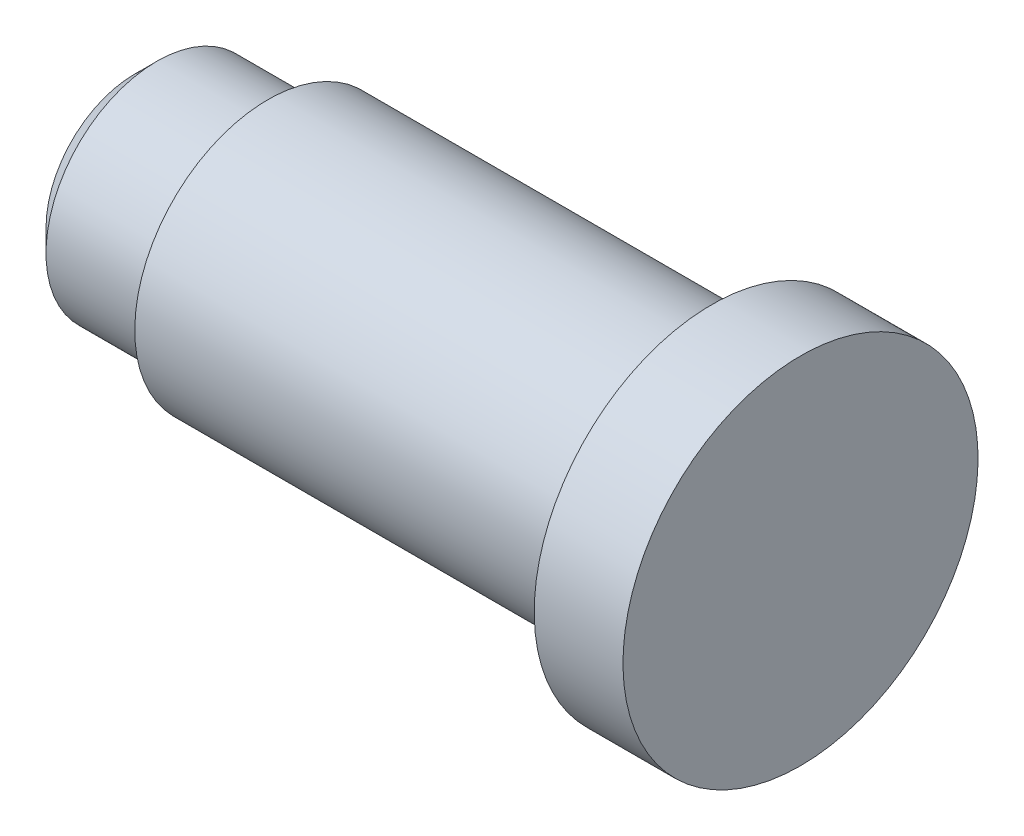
ISO-10303-21;
HEADER;
FILE_DESCRIPTION(('STEP AP214'),'2;1');
FILE_NAME('part.step','',(''),(''),'','','');
FILE_SCHEMA(('AUTOMOTIVE_DESIGN { 1 0 10303 214 1 1 1 1 }'));
ENDSEC;
DATA;
#1=APPLICATION_CONTEXT('core data for automotive mechanical design processes');
#2=APPLICATION_PROTOCOL_DEFINITION('international standard','automotive_design',2000,#1);
#3=PRODUCT_CONTEXT('',#1,'mechanical');
#4=PRODUCT('Part','Part','',(#3));
#5=PRODUCT_RELATED_PRODUCT_CATEGORY('part','',(#4));
#6=PRODUCT_DEFINITION_FORMATION('','',#4);
#7=PRODUCT_DEFINITION_CONTEXT('part definition',#1,'design');
#8=PRODUCT_DEFINITION('design','',#6,#7);
#9=PRODUCT_DEFINITION_SHAPE('','',#8);
#10=(LENGTH_UNIT() NAMED_UNIT(*) SI_UNIT(.MILLI.,.METRE.));
#11=(NAMED_UNIT(*) PLANE_ANGLE_UNIT() SI_UNIT($,.RADIAN.));
#12=(NAMED_UNIT(*) SI_UNIT($,.STERADIAN.) SOLID_ANGLE_UNIT());
#13=UNCERTAINTY_MEASURE_WITH_UNIT(LENGTH_MEASURE(1.E-05),#10,'distance_accuracy_value','');
#14=(GEOMETRIC_REPRESENTATION_CONTEXT(3) GLOBAL_UNCERTAINTY_ASSIGNED_CONTEXT((#13)) GLOBAL_UNIT_ASSIGNED_CONTEXT((#10,
#11,#12)) REPRESENTATION_CONTEXT('',''));
#15=CARTESIAN_POINT('',(0.,0.,0.));
#16=DIRECTION('',(0.,0.,1.));
#17=DIRECTION('',(1.,0.,0.));
#18=AXIS2_PLACEMENT_3D('',#15,#16,#17);
#19=CARTESIAN_POINT('',(-21.7406772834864,1.99999999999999,0.));
#20=DIRECTION('',(1.,0.,0.));
#21=DIRECTION('',(0.,1.,0.));
#22=AXIS2_PLACEMENT_3D('',#19,#20,#21);
#23=PLANE('',#22);
#24=CARTESIAN_POINT('',(-21.7406772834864,0.,0.));
#25=DIRECTION('',(-1.,0.,0.));
#26=DIRECTION('',(0.,-1.,0.));
#27=AXIS2_PLACEMENT_3D('',#24,#25,#26);
#28=CIRCLE('',#27,1.99999999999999);
#29=CARTESIAN_POINT('',(-21.7406772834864,-1.99999999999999,0.));
#30=VERTEX_POINT('',#29);
#31=EDGE_CURVE('E55',#30,#30,#28,.T.);
#32=ORIENTED_EDGE('',*,*,#31,.T.);
#33=EDGE_LOOP('',(#32));
#34=FACE_BOUND('',#33,.T.);
#35=ADVANCED_FACE('F30',(#34),#23,.F.);
#36=CARTESIAN_POINT('',(-6.74067728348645,4.,0.));
#37=DIRECTION('',(-1.,0.,0.));
#38=DIRECTION('',(0.,-1.,0.));
#39=AXIS2_PLACEMENT_3D('',#36,#37,#38);
#40=PLANE('',#39);
#41=CARTESIAN_POINT('',(-6.74067728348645,0.,0.));
#42=DIRECTION('',(-1.,0.,0.));
#43=DIRECTION('',(0.,-1.,0.));
#44=AXIS2_PLACEMENT_3D('',#41,#42,#43);
#45=CIRCLE('',#44,4.);
#46=CARTESIAN_POINT('',(-6.74067728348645,-4.,0.));
#47=VERTEX_POINT('',#46);
#48=EDGE_CURVE('E10',#47,#47,#45,.T.);
#49=ORIENTED_EDGE('',*,*,#48,.F.);
#50=EDGE_LOOP('',(#49));
#51=FACE_BOUND('',#50,.T.);
#52=ADVANCED_FACE('F91',(#51),#40,.F.);
#53=CARTESIAN_POINT('',(-21.7406772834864,0.,0.));
#54=DIRECTION('',(-1.,0.,0.));
#55=DIRECTION('',(0.,-1.,0.));
#56=AXIS2_PLACEMENT_3D('',#53,#54,#55);
#57=CYLINDRICAL_SURFACE('',#56,4.);
#58=CARTESIAN_POINT('',(-8.74067728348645,0.,0.));
#59=DIRECTION('',(-1.,0.,0.));
#60=DIRECTION('',(0.,-1.,0.));
#61=AXIS2_PLACEMENT_3D('',#58,#59,#60);
#62=CIRCLE('',#61,4.);
#63=CARTESIAN_POINT('',(-8.74067728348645,-4.,0.));
#64=VERTEX_POINT('',#63);
#65=EDGE_CURVE('E36',#64,#64,#62,.T.);
#66=ORIENTED_EDGE('',*,*,#65,.F.);
#67=EDGE_LOOP('',(#66));
#68=FACE_BOUND('',#67,.T.);
#69=ORIENTED_EDGE('',*,*,#48,.T.);
#70=EDGE_LOOP('',(#69));
#71=FACE_BOUND('',#70,.T.);
#72=ADVANCED_FACE('F86',(#68,#71),#57,.T.);
#73=CARTESIAN_POINT('',(-8.74067728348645,3.,0.));
#74=DIRECTION('',(1.,0.,0.));
#75=DIRECTION('',(0.,1.,0.));
#76=AXIS2_PLACEMENT_3D('',#73,#74,#75);
#77=PLANE('',#76);
#78=CARTESIAN_POINT('',(-8.74067728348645,0.,0.));
#79=DIRECTION('',(-1.,0.,0.));
#80=DIRECTION('',(0.,-1.,0.));
#81=AXIS2_PLACEMENT_3D('',#78,#79,#80);
#82=CIRCLE('',#81,3.);
#83=CARTESIAN_POINT('',(-8.74067728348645,-3.,0.));
#84=VERTEX_POINT('',#83);
#85=EDGE_CURVE('E40',#84,#84,#82,.T.);
#86=ORIENTED_EDGE('',*,*,#85,.F.);
#87=EDGE_LOOP('',(#86));
#88=FACE_BOUND('',#87,.T.);
#89=ORIENTED_EDGE('',*,*,#65,.T.);
#90=EDGE_LOOP('',(#89));
#91=FACE_BOUND('',#90,.T.);
#92=ADVANCED_FACE('F81',(#88,#91),#77,.F.);
#93=CARTESIAN_POINT('',(-21.7406772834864,0.,0.));
#94=DIRECTION('',(-1.,0.,0.));
#95=DIRECTION('',(0.,-1.,0.));
#96=AXIS2_PLACEMENT_3D('',#93,#94,#95);
#97=CYLINDRICAL_SURFACE('',#96,3.);
#98=CARTESIAN_POINT('',(-18.7406772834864,0.,0.));
#99=DIRECTION('',(-1.,0.,0.));
#100=DIRECTION('',(0.,-1.,0.));
#101=AXIS2_PLACEMENT_3D('',#98,#99,#100);
#102=CIRCLE('',#101,3.);
#103=CARTESIAN_POINT('',(-18.7406772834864,-3.,0.));
#104=VERTEX_POINT('',#103);
#105=EDGE_CURVE('E44',#104,#104,#102,.T.);
#106=ORIENTED_EDGE('',*,*,#105,.F.);
#107=EDGE_LOOP('',(#106));
#108=FACE_BOUND('',#107,.T.);
#109=ORIENTED_EDGE('',*,*,#85,.T.);
#110=EDGE_LOOP('',(#109));
#111=FACE_BOUND('',#110,.T.);
#112=ADVANCED_FACE('F75',(#108,#111),#97,.T.);
#113=CARTESIAN_POINT('',(-18.7406772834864,3.,0.));
#114=DIRECTION('',(1.,0.,0.));
#115=DIRECTION('',(0.,1.,0.));
#116=AXIS2_PLACEMENT_3D('',#113,#114,#115);
#117=PLANE('',#116);
#118=CARTESIAN_POINT('',(-18.7406772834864,0.,0.));
#119=DIRECTION('',(-1.,0.,0.));
#120=DIRECTION('',(0.,-1.,0.));
#121=AXIS2_PLACEMENT_3D('',#118,#119,#120);
#122=CIRCLE('',#121,2.5);
#123=CARTESIAN_POINT('',(-18.7406772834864,-2.5,0.));
#124=VERTEX_POINT('',#123);
#125=EDGE_CURVE('E49',#124,#124,#122,.T.);
#126=ORIENTED_EDGE('',*,*,#125,.F.);
#127=EDGE_LOOP('',(#126));
#128=FACE_BOUND('',#127,.T.);
#129=ORIENTED_EDGE('',*,*,#105,.T.);
#130=EDGE_LOOP('',(#129));
#131=FACE_BOUND('',#130,.T.);
#132=ADVANCED_FACE('F69',(#128,#131),#117,.F.);
#133=CARTESIAN_POINT('',(-21.7406772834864,0.,0.));
#134=DIRECTION('',(-1.,0.,0.));
#135=DIRECTION('',(0.,-1.,0.));
#136=AXIS2_PLACEMENT_3D('',#133,#134,#135);
#137=CYLINDRICAL_SURFACE('',#136,2.5);
#138=CARTESIAN_POINT('',(-21.2406772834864,0.,0.));
#139=DIRECTION('',(-1.,0.,0.));
#140=DIRECTION('',(0.,-1.,0.));
#141=AXIS2_PLACEMENT_3D('',#138,#139,#140);
#142=CIRCLE('',#141,2.5);
#143=CARTESIAN_POINT('',(-21.2406772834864,-2.5,0.));
#144=VERTEX_POINT('',#143);
#145=EDGE_CURVE('E52',#144,#144,#142,.T.);
#146=ORIENTED_EDGE('',*,*,#145,.F.);
#147=EDGE_LOOP('',(#146));
#148=FACE_BOUND('',#147,.T.);
#149=ORIENTED_EDGE('',*,*,#125,.T.);
#150=EDGE_LOOP('',(#149));
#151=FACE_BOUND('',#150,.T.);
#152=ADVANCED_FACE('F63',(#148,#151),#137,.T.);
#153=CARTESIAN_POINT('',(-21.2406772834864,0.,0.));
#154=DIRECTION('',(1.,0.,0.));
#155=DIRECTION('',(0.,1.,0.));
#156=AXIS2_PLACEMENT_3D('',#153,#154,#155);
#157=CONICAL_SURFACE('',#156,2.5,0.785398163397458);
#158=ORIENTED_EDGE('',*,*,#31,.F.);
#159=EDGE_LOOP('',(#158));
#160=FACE_BOUND('',#159,.T.);
#161=ORIENTED_EDGE('',*,*,#145,.T.);
#162=EDGE_LOOP('',(#161));
#163=FACE_BOUND('',#162,.T.);
#164=ADVANCED_FACE('F60',(#160,#163),#157,.T.);
#165=CLOSED_SHELL('',(#35,#52,#72,#92,#112,#132,#152,#164));
#166=MANIFOLD_SOLID_BREP('B2',#165);
#167=ADVANCED_BREP_SHAPE_REPRESENTATION('',(#18,#166),#14);
#168=SHAPE_DEFINITION_REPRESENTATION(#9,#167);
ENDSEC;
END-ISO-10303-21;
